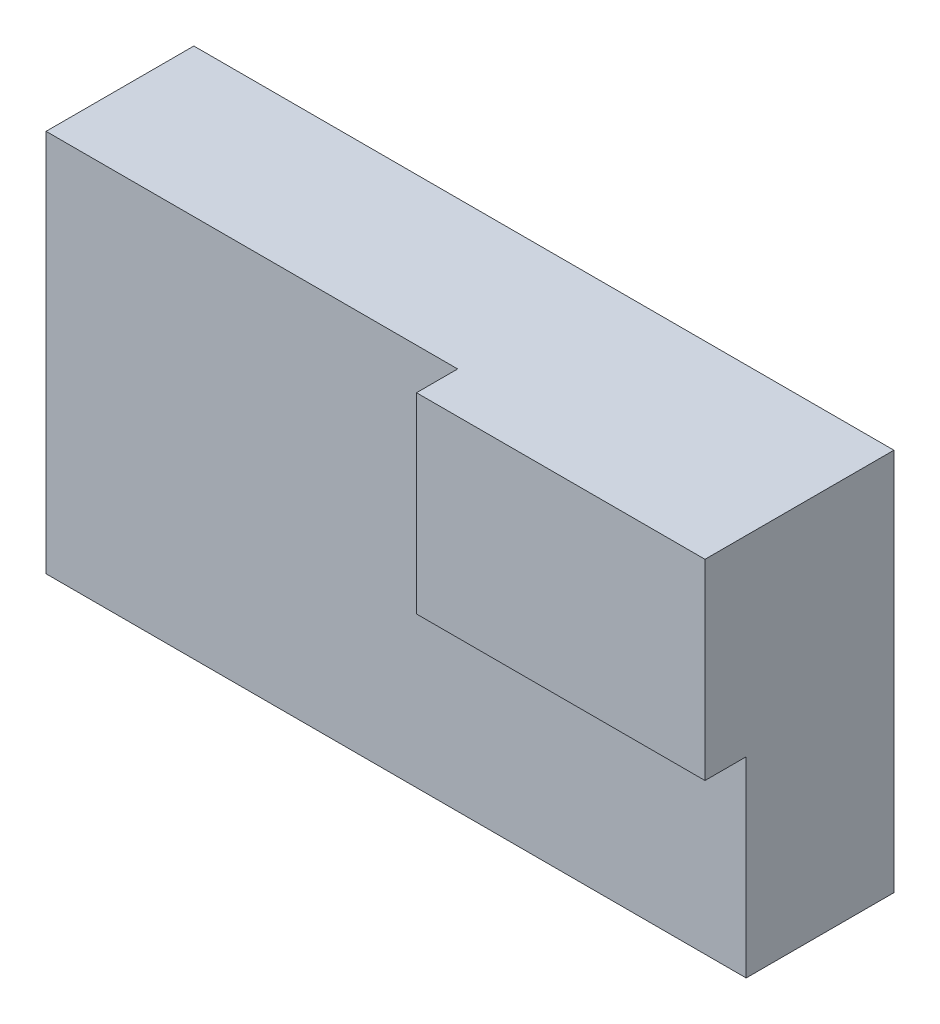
from build123d import *

# Parameters (mm, degrees)
SKETCH1_W           = 170.024730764
SKETCH1_H           = 93.066714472
EXTRUDE1_DEPTH      = 35.886761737
BOSS_EXTRUDE2_START = 115.88676
SKETCH3_W           = 70.061914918
SKETCH3_H           = 46.533357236
BOSS_EXTRUDE2_DEPTH = 10


with BuildPart() as part:
    # Sketch1 → Extrude1 (new body)
    with BuildSketch(Plane.XY):
        Rectangle(SKETCH1_W, SKETCH1_H)
    extrude(amount=EXTRUDE1_DEPTH)

    # Sketch3 → Boss-Extrude2 (add)
    with BuildSketch(Plane.XY.offset(-80).offset(BOSS_EXTRUDE2_START)):
        with Locations((49.981407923, 23.266678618)):
            Rectangle(SKETCH3_W, SKETCH3_H)
    extrude(amount=BOSS_EXTRUDE2_DEPTH)


solid = part.part
